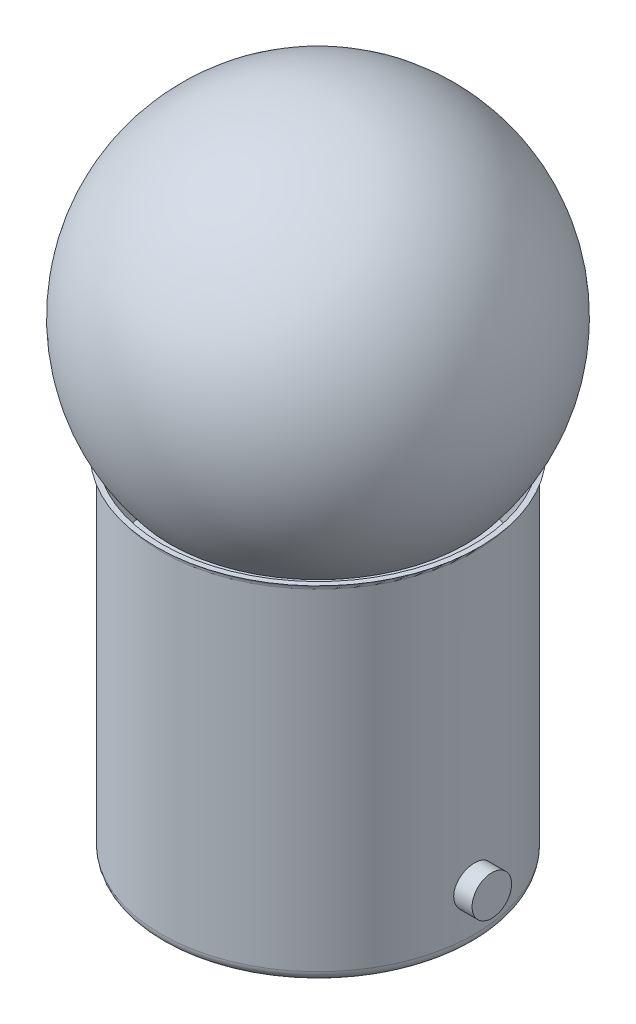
ISO-10303-21;
HEADER;
FILE_DESCRIPTION(('STEP AP214'),'2;1');
FILE_NAME('part.step','',(''),(''),'','','');
FILE_SCHEMA(('AUTOMOTIVE_DESIGN { 1 0 10303 214 1 1 1 1 }'));
ENDSEC;
DATA;
#1=APPLICATION_CONTEXT('core data for automotive mechanical design processes');
#2=APPLICATION_PROTOCOL_DEFINITION('international standard','automotive_design',2000,#1);
#3=PRODUCT_CONTEXT('',#1,'mechanical');
#4=PRODUCT('Part','Part','',(#3));
#5=PRODUCT_RELATED_PRODUCT_CATEGORY('part','',(#4));
#6=PRODUCT_DEFINITION_FORMATION('','',#4);
#7=PRODUCT_DEFINITION_CONTEXT('part definition',#1,'design');
#8=PRODUCT_DEFINITION('design','',#6,#7);
#9=PRODUCT_DEFINITION_SHAPE('','',#8);
#10=(LENGTH_UNIT() NAMED_UNIT(*) SI_UNIT(.MILLI.,.METRE.));
#11=(NAMED_UNIT(*) PLANE_ANGLE_UNIT() SI_UNIT($,.RADIAN.));
#12=(NAMED_UNIT(*) SI_UNIT($,.STERADIAN.) SOLID_ANGLE_UNIT());
#13=UNCERTAINTY_MEASURE_WITH_UNIT(LENGTH_MEASURE(1.E-05),#10,'distance_accuracy_value','');
#14=(GEOMETRIC_REPRESENTATION_CONTEXT(3) GLOBAL_UNCERTAINTY_ASSIGNED_CONTEXT((#13)) GLOBAL_UNIT_ASSIGNED_CONTEXT((#10,
#11,#12)) REPRESENTATION_CONTEXT('',''));
#15=CARTESIAN_POINT('',(0.,0.,0.));
#16=DIRECTION('',(0.,0.,1.));
#17=DIRECTION('',(1.,0.,0.));
#18=AXIS2_PLACEMENT_3D('',#15,#16,#17);
#19=CARTESIAN_POINT('',(0.,22.4917,0.));
#20=DIRECTION('',(0.,1.,0.));
#21=DIRECTION('',(0.,0.,-1.));
#22=AXIS2_PLACEMENT_3D('',#19,#20,#21);
#23=SPHERICAL_SURFACE('',#22,9.2583);
#24=CARTESIAN_POINT('',(0.,16.5639650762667,0.));
#25=DIRECTION('',(0.,1.,0.));
#26=DIRECTION('',(0.,0.,1.));
#27=AXIS2_PLACEMENT_3D('',#24,#25,#26);
#28=CIRCLE('',#27,7.11182659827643);
#29=CARTESIAN_POINT('',(0.,16.5639650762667,7.11182659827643));
#30=VERTEX_POINT('',#29);
#31=EDGE_CURVE('E11',#30,#30,#28,.T.);
#32=ORIENTED_EDGE('',*,*,#31,.T.);
#33=EDGE_LOOP('',(#32));
#34=FACE_BOUND('',#33,.T.);
#35=ADVANCED_FACE('F43',(#34),#23,.T.);
#36=CARTESIAN_POINT('',(0.,16.5639650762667,0.));
#37=DIRECTION('',(0.,1.,0.));
#38=DIRECTION('',(0.,0.,1.));
#39=AXIS2_PLACEMENT_3D('',#36,#37,#38);
#40=PLANE('',#39);
#41=ORIENTED_EDGE('',*,*,#31,.F.);
#42=EDGE_LOOP('',(#41));
#43=FACE_BOUND('',#42,.T.);
#44=ADVANCED_FACE('F51',(#43),#40,.F.);
#45=CLOSED_SHELL('',(#35,#44));
#46=MANIFOLD_SOLID_BREP('B2',#45);
#47=CARTESIAN_POINT('',(0.,0.,0.));
#48=DIRECTION('',(0.,1.,0.));
#49=DIRECTION('',(0.,0.,1.));
#50=AXIS2_PLACEMENT_3D('',#47,#48,#49);
#51=PLANE('',#50);
#52=CARTESIAN_POINT('',(0.,0.,0.));
#53=DIRECTION('',(0.,1.,0.));
#54=DIRECTION('',(0.,0.,1.));
#55=AXIS2_PLACEMENT_3D('',#52,#53,#54);
#56=CIRCLE('',#55,7.0485);
#57=CARTESIAN_POINT('',(0.,0.,7.0485));
#58=VERTEX_POINT('',#57);
#59=EDGE_CURVE('E80',#58,#58,#56,.F.);
#60=ORIENTED_EDGE('',*,*,#59,.T.);
#61=EDGE_LOOP('',(#60));
#62=FACE_BOUND('',#61,.T.);
#63=CARTESIAN_POINT('',(0.,0.,0.));
#64=DIRECTION('',(0.,1.,0.));
#65=DIRECTION('',(0.,0.,1.));
#66=AXIS2_PLACEMENT_3D('',#63,#64,#65);
#67=CIRCLE('',#66,3.8862);
#68=CARTESIAN_POINT('',(0.,0.,3.8862));
#69=VERTEX_POINT('',#68);
#70=EDGE_CURVE('E42',#69,#69,#67,.F.);
#71=ORIENTED_EDGE('',*,*,#70,.F.);
#72=EDGE_LOOP('',(#71));
#73=FACE_BOUND('',#72,.T.);
#74=ADVANCED_FACE('F69',(#62,#73),#51,.F.);
#75=CARTESIAN_POINT('',(0.,16.4846,0.));
#76=DIRECTION('',(0.,-1.,0.));
#77=DIRECTION('',(0.,0.,-1.));
#78=AXIS2_PLACEMENT_3D('',#75,#76,#77);
#79=CYLINDRICAL_SURFACE('',#78,7.5565);
#80=CARTESIAN_POINT('',(-7.49622811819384,2.54,-0.9525));
#81=CARTESIAN_POINT('',(-7.49622888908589,2.59327382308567,-0.952497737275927));
#82=CARTESIAN_POINT('',(-7.49680215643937,2.64658085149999,-0.948015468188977));
#83=CARTESIAN_POINT('',(-7.49903239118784,2.75171110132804,-0.930205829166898));
#84=CARTESIAN_POINT('',(-7.50069048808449,2.80353271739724,-0.916869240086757));
#85=CARTESIAN_POINT('',(-7.50489965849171,2.90415482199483,-0.881750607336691));
#86=CARTESIAN_POINT('',(-7.50745012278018,2.95295734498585,-0.859974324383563));
#87=CARTESIAN_POINT('',(-7.51315592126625,3.0462063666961,-0.808606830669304));
#88=CARTESIAN_POINT('',(-7.5163111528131,3.09065360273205,-0.779016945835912));
#89=CARTESIAN_POINT('',(-7.52289107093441,3.17419221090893,-0.712681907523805));
#90=CARTESIAN_POINT('',(-7.52631704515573,3.21325522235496,-0.675901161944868));
#91=CARTESIAN_POINT('',(-7.53304085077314,3.2846715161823,-0.596305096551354));
#92=CARTESIAN_POINT('',(-7.53633867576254,3.31702446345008,-0.55348947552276));
#93=CARTESIAN_POINT('',(-7.54244779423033,3.37420408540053,-0.462860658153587));
#94=CARTESIAN_POINT('',(-7.54525741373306,3.39900507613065,-0.415031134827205));
#95=CARTESIAN_POINT('',(-7.55005939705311,3.44021225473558,-0.315844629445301));
#96=CARTESIAN_POINT('',(-7.55205179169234,3.45661875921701,-0.264487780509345));
#97=CARTESIAN_POINT('',(-7.55498576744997,3.48048646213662,-0.159994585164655));
#98=CARTESIAN_POINT('',(-7.5559328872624,3.48799482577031,-0.106869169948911));
#99=CARTESIAN_POINT('',(-7.55668851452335,3.49399929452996,-0.000104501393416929));
#100=CARTESIAN_POINT('',(-7.55649706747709,3.49249575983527,0.0535347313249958));
#101=CARTESIAN_POINT('',(-7.55500161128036,3.48055688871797,0.159483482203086));
#102=CARTESIAN_POINT('',(-7.5537039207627,3.47017227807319,0.211798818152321));
#103=CARTESIAN_POINT('',(-7.55014888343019,3.44084534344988,0.313938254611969));
#104=CARTESIAN_POINT('',(-7.5478915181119,3.42190285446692,0.363762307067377));
#105=CARTESIAN_POINT('',(-7.54265989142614,3.37594400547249,0.459661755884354));
#106=CARTESIAN_POINT('',(-7.53968368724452,3.34890571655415,0.50572653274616));
#107=CARTESIAN_POINT('',(-7.53334730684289,3.28753874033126,0.592683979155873));
#108=CARTESIAN_POINT('',(-7.52998711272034,3.25320971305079,0.633576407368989));
#109=CARTESIAN_POINT('',(-7.52323118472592,3.17795168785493,0.709326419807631));
#110=CARTESIAN_POINT('',(-7.51983536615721,3.13697847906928,0.744140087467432));
#111=CARTESIAN_POINT('',(-7.51341395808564,3.04974698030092,0.806402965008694));
#112=CARTESIAN_POINT('',(-7.5103883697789,3.00348867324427,0.833852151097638));
#113=CARTESIAN_POINT('',(-7.50505002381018,2.90696069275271,0.88060952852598));
#114=CARTESIAN_POINT('',(-7.50273757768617,2.85668927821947,0.899914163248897));
#115=CARTESIAN_POINT('',(-7.4990933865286,2.75358260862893,0.929795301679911));
#116=CARTESIAN_POINT('',(-7.49776159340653,2.70074747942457,0.940372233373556));
#117=CARTESIAN_POINT('',(-7.49623829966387,2.59440115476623,0.952439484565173));
#118=CARTESIAN_POINT('',(-7.49603904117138,2.54089708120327,0.953991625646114));
#119=CARTESIAN_POINT('',(-7.49678285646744,2.43439165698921,0.948128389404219));
#120=CARTESIAN_POINT('',(-7.4977259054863,2.38139029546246,0.940713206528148));
#121=CARTESIAN_POINT('',(-7.50064099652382,2.27758031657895,0.917177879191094));
#122=CARTESIAN_POINT('',(-7.50260949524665,2.22676479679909,0.901087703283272));
#123=CARTESIAN_POINT('',(-7.50735080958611,2.12855296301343,0.860689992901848));
#124=CARTESIAN_POINT('',(-7.51012365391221,2.08115677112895,0.83638216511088));
#125=CARTESIAN_POINT('',(-7.51617979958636,1.99084939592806,0.780087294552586));
#126=CARTESIAN_POINT('',(-7.51946576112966,1.94796365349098,0.748059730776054));
#127=CARTESIAN_POINT('',(-7.52616955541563,1.86815420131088,0.677291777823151));
#128=CARTESIAN_POINT('',(-7.52958739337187,1.83123072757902,0.638551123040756));
#129=CARTESIAN_POINT('',(-7.53619368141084,1.76417657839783,0.555186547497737));
#130=CARTESIAN_POINT('',(-7.53938068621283,1.73408653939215,0.51052980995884));
#131=CARTESIAN_POINT('',(-7.545144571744,1.68183465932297,0.416760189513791));
#132=CARTESIAN_POINT('',(-7.54772146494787,1.6596726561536,0.367647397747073));
#133=CARTESIAN_POINT('',(-7.55196836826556,1.62397296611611,0.266494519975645));
#134=CARTESIAN_POINT('',(-7.55364084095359,1.61041184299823,0.214462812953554));
#135=CARTESIAN_POINT('',(-7.55590069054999,1.59222263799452,0.108838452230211));
#136=CARTESIAN_POINT('',(-7.55648811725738,1.58759414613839,0.0552458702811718));
#137=CARTESIAN_POINT('',(-7.55651144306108,1.58740934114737,-0.0515822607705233));
#138=CARTESIAN_POINT('',(-7.55595529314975,1.59179038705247,-0.104817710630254));
#139=CARTESIAN_POINT('',(-7.55376976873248,1.60936756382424,-0.209789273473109));
#140=CARTESIAN_POINT('',(-7.55214039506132,1.62256368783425,-0.261525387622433));
#141=CARTESIAN_POINT('',(-7.54799068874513,1.65737666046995,-0.362021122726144));
#142=CARTESIAN_POINT('',(-7.54547067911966,1.67899045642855,-0.410781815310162));
#143=CARTESIAN_POINT('',(-7.53981865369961,1.73001874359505,-0.503993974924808));
#144=CARTESIAN_POINT('',(-7.53668663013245,1.75943333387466,-0.548445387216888));
#145=CARTESIAN_POINT('',(-7.53013415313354,1.8254598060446,-0.632097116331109));
#146=CARTESIAN_POINT('',(-7.52671191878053,1.86211828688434,-0.67126051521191));
#147=CARTESIAN_POINT('',(-7.51997897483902,1.94149507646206,-0.7429043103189));
#148=CARTESIAN_POINT('',(-7.51666829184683,1.98421481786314,-0.775383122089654));
#149=CARTESIAN_POINT('',(-7.51051943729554,2.07469406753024,-0.832845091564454));
#150=CARTESIAN_POINT('',(-7.50768317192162,2.12247270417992,-0.857798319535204));
#151=CARTESIAN_POINT('',(-7.50282662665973,2.2215514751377,-0.899291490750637));
#152=CARTESIAN_POINT('',(-7.50080546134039,2.27284771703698,-0.9158405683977));
#153=CARTESIAN_POINT('',(-7.49829780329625,2.36034012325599,-0.936101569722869));
#154=CARTESIAN_POINT('',(-7.49752554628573,2.39598482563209,-0.942242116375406));
#155=CARTESIAN_POINT('',(-7.49649044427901,2.46774792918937,-0.950442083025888));
#156=CARTESIAN_POINT('',(-7.49622759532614,2.50386632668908,-0.952501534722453));
#157=CARTESIAN_POINT('',(-7.49622811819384,2.54,-0.9525));
#158=B_SPLINE_CURVE_WITH_KNOTS('',3,(#80,#81,#82,#83,#84,#85,#86,#87,#88,#89,#90,#91,#92,#93,
#94,#95,#96,#97,#98,#99,#100,#101,#102,#103,#104,#105,#106,#107,#108,#109,#110,#111,#112,#113,
#114,#115,#116,#117,#118,#119,#120,#121,#122,#123,#124,#125,#126,#127,#128,#129,#130,#131,#132,
#133,#134,#135,#136,#137,#138,#139,#140,#141,#142,#143,#144,#145,#146,#147,#148,#149,#150,#151,
#152,#153,#154,#155,#156,#157),.UNSPECIFIED.,.T.,.F.,(4,2,2,2,2,2,2,2,2,2,2,2,2,2,2,2,2,2,2,2,2,
2,2,2,2,2,2,2,2,2,2,2,2,2,2,2,2,2,4),(0.,0.159689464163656,0.319545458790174,0.479292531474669,
0.639012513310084,0.799544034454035,0.960083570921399,1.12116315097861,1.28223665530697,
1.44245250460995,1.6026619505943,1.76196239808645,1.92126591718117,2.08100490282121,
2.24075133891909,2.40160799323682,2.56246516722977,2.72339251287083,2.88431196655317,
3.04412777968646,3.20394012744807,3.36320389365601,3.52247334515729,3.68259774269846,
3.84272847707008,4.0037878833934,4.16484399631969,4.32545934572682,4.48606732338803,
4.64556241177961,4.80505737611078,4.9644945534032,5.12393375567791,5.28443411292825,
5.44497247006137,5.60614112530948,5.76713423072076,5.87544655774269,5.98375804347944),.UNSPECIFIED.);
#159=CARTESIAN_POINT('',(-7.49622811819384,2.54,-0.9525));
#160=VERTEX_POINT('',#159);
#161=EDGE_CURVE('E73',#160,#160,#158,.T.);
#162=ORIENTED_EDGE('',*,*,#161,.T.);
#163=EDGE_LOOP('',(#162));
#164=FACE_BOUND('',#163,.T.);
#165=CARTESIAN_POINT('',(7.49622811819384,2.54,-0.9525));
#166=CARTESIAN_POINT('',(7.49622888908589,2.48672617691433,-0.952497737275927));
#167=CARTESIAN_POINT('',(7.49680215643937,2.43341914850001,-0.948015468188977));
#168=CARTESIAN_POINT('',(7.49903239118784,2.32828889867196,-0.930205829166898));
#169=CARTESIAN_POINT('',(7.50069048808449,2.27646728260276,-0.916869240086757));
#170=CARTESIAN_POINT('',(7.50489965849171,2.17584517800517,-0.881750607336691));
#171=CARTESIAN_POINT('',(7.50745012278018,2.12704265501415,-0.859974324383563));
#172=CARTESIAN_POINT('',(7.51315592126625,2.0337936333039,-0.808606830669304));
#173=CARTESIAN_POINT('',(7.5163111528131,1.98934639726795,-0.779016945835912));
#174=CARTESIAN_POINT('',(7.52289107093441,1.90580778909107,-0.712681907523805));
#175=CARTESIAN_POINT('',(7.52631704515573,1.86674477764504,-0.675901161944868));
#176=CARTESIAN_POINT('',(7.53304085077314,1.79532848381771,-0.596305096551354));
#177=CARTESIAN_POINT('',(7.53633867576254,1.76297553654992,-0.55348947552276));
#178=CARTESIAN_POINT('',(7.54244779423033,1.70579591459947,-0.462860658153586));
#179=CARTESIAN_POINT('',(7.54525741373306,1.68099492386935,-0.415031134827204));
#180=CARTESIAN_POINT('',(7.55005939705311,1.63978774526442,-0.315844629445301));
#181=CARTESIAN_POINT('',(7.55205179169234,1.62338124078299,-0.264487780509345));
#182=CARTESIAN_POINT('',(7.55498576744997,1.59951353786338,-0.159994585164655));
#183=CARTESIAN_POINT('',(7.5559328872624,1.59200517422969,-0.106869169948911));
#184=CARTESIAN_POINT('',(7.55668851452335,1.58600070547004,-0.000104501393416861));
#185=CARTESIAN_POINT('',(7.55649706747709,1.58750424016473,0.0535347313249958));
#186=CARTESIAN_POINT('',(7.55500161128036,1.59944311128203,0.159483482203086));
#187=CARTESIAN_POINT('',(7.5537039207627,1.60982772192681,0.211798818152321));
#188=CARTESIAN_POINT('',(7.55014888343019,1.63915465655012,0.313938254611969));
#189=CARTESIAN_POINT('',(7.5478915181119,1.65809714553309,0.363762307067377));
#190=CARTESIAN_POINT('',(7.54265989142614,1.70405599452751,0.459661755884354));
#191=CARTESIAN_POINT('',(7.53968368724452,1.73109428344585,0.50572653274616));
#192=CARTESIAN_POINT('',(7.53334730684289,1.79246125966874,0.592683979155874));
#193=CARTESIAN_POINT('',(7.52998711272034,1.82679028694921,0.63357640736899));
#194=CARTESIAN_POINT('',(7.52323118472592,1.90204831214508,0.709326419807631));
#195=CARTESIAN_POINT('',(7.51983536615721,1.94302152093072,0.744140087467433));
#196=CARTESIAN_POINT('',(7.51341395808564,2.03025301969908,0.806402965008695));
#197=CARTESIAN_POINT('',(7.5103883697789,2.07651132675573,0.833852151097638));
#198=CARTESIAN_POINT('',(7.50505002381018,2.17303930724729,0.880609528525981));
#199=CARTESIAN_POINT('',(7.50273757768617,2.22331072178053,0.899914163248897));
#200=CARTESIAN_POINT('',(7.4990933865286,2.32641739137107,0.929795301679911));
#201=CARTESIAN_POINT('',(7.49776159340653,2.37925252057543,0.940372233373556));
#202=CARTESIAN_POINT('',(7.49623829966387,2.48559884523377,0.952439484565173));
#203=CARTESIAN_POINT('',(7.49603904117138,2.53910291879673,0.953991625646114));
#204=CARTESIAN_POINT('',(7.49678285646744,2.6456083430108,0.948128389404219));
#205=CARTESIAN_POINT('',(7.4977259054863,2.69860970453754,0.940713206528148));
#206=CARTESIAN_POINT('',(7.50064099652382,2.80241968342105,0.917177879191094));
#207=CARTESIAN_POINT('',(7.50260949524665,2.85323520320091,0.901087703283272));
#208=CARTESIAN_POINT('',(7.50735080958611,2.95144703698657,0.860689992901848));
#209=CARTESIAN_POINT('',(7.51012365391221,2.99884322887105,0.83638216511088));
#210=CARTESIAN_POINT('',(7.51617979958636,3.08915060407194,0.780087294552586));
#211=CARTESIAN_POINT('',(7.51946576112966,3.13203634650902,0.748059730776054));
#212=CARTESIAN_POINT('',(7.52616955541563,3.21184579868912,0.677291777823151));
#213=CARTESIAN_POINT('',(7.52958739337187,3.24876927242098,0.638551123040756));
#214=CARTESIAN_POINT('',(7.53619368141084,3.31582342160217,0.555186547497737));
#215=CARTESIAN_POINT('',(7.53938068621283,3.34591346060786,0.51052980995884));
#216=CARTESIAN_POINT('',(7.545144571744,3.39816534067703,0.41676018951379));
#217=CARTESIAN_POINT('',(7.54772146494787,3.4203273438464,0.367647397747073));
#218=CARTESIAN_POINT('',(7.55196836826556,3.45602703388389,0.266494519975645));
#219=CARTESIAN_POINT('',(7.55364084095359,3.46958815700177,0.214462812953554));
#220=CARTESIAN_POINT('',(7.55590069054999,3.48777736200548,0.108838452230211));
#221=CARTESIAN_POINT('',(7.55648811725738,3.49240585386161,0.0552458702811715));
#222=CARTESIAN_POINT('',(7.55651144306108,3.49259065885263,-0.0515822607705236));
#223=CARTESIAN_POINT('',(7.55595529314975,3.48820961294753,-0.104817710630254));
#224=CARTESIAN_POINT('',(7.55376976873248,3.47063243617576,-0.209789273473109));
#225=CARTESIAN_POINT('',(7.55214039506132,3.45743631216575,-0.261525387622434));
#226=CARTESIAN_POINT('',(7.54799068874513,3.42262333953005,-0.362021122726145));
#227=CARTESIAN_POINT('',(7.54547067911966,3.40100954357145,-0.410781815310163));
#228=CARTESIAN_POINT('',(7.53981865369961,3.34998125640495,-0.503993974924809));
#229=CARTESIAN_POINT('',(7.53668663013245,3.32056666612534,-0.548445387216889));
#230=CARTESIAN_POINT('',(7.53013415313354,3.2545401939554,-0.632097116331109));
#231=CARTESIAN_POINT('',(7.52671191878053,3.21788171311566,-0.67126051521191));
#232=CARTESIAN_POINT('',(7.51997897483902,3.13850492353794,-0.7429043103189));
#233=CARTESIAN_POINT('',(7.51666829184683,3.09578518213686,-0.775383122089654));
#234=CARTESIAN_POINT('',(7.51051943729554,3.00530593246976,-0.832845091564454));
#235=CARTESIAN_POINT('',(7.50768317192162,2.95752729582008,-0.857798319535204));
#236=CARTESIAN_POINT('',(7.50282662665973,2.8584485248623,-0.899291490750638));
#237=CARTESIAN_POINT('',(7.50080546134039,2.80715228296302,-0.9158405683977));
#238=CARTESIAN_POINT('',(7.49829780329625,2.71965987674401,-0.936101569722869));
#239=CARTESIAN_POINT('',(7.49752554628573,2.68401517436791,-0.942242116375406));
#240=CARTESIAN_POINT('',(7.49649044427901,2.61225207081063,-0.950442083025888));
#241=CARTESIAN_POINT('',(7.49622759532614,2.57613367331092,-0.952501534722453));
#242=CARTESIAN_POINT('',(7.49622811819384,2.54,-0.9525));
#243=B_SPLINE_CURVE_WITH_KNOTS('',3,(#165,#166,#167,#168,#169,#170,#171,#172,#173,#174,#175,
#176,#177,#178,#179,#180,#181,#182,#183,#184,#185,#186,#187,#188,#189,#190,#191,#192,#193,#194,
#195,#196,#197,#198,#199,#200,#201,#202,#203,#204,#205,#206,#207,#208,#209,#210,#211,#212,#213,
#214,#215,#216,#217,#218,#219,#220,#221,#222,#223,#224,#225,#226,#227,#228,#229,#230,#231,#232,
#233,#234,#235,#236,#237,#238,#239,#240,#241,#242),.UNSPECIFIED.,.T.,.F.,(4,2,2,2,2,2,2,2,2,2,2,
2,2,2,2,2,2,2,2,2,2,2,2,2,2,2,2,2,2,2,2,2,2,2,2,2,2,2,4),(0.,0.159689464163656,
0.319545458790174,0.479292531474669,0.639012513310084,0.799544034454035,0.9600835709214,
1.12116315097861,1.28223665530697,1.44245250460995,1.6026619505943,1.76196239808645,
1.92126591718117,2.08100490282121,2.24075133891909,2.40160799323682,2.56246516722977,
2.72339251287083,2.88431196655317,3.04412777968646,3.20394012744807,3.36320389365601,
3.52247334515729,3.68259774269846,3.84272847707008,4.0037878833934,4.16484399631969,
4.32545934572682,4.48606732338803,4.64556241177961,4.80505737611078,4.9644945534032,
5.12393375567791,5.28443411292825,5.44497247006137,5.60614112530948,5.76713423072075,
5.87544655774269,5.98375804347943),.UNSPECIFIED.);
#244=CARTESIAN_POINT('',(7.49622811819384,2.54,-0.9525));
#245=VERTEX_POINT('',#244);
#246=EDGE_CURVE('E88',#245,#245,#243,.T.);
#247=ORIENTED_EDGE('',*,*,#246,.T.);
#248=EDGE_LOOP('',(#247));
#249=FACE_BOUND('',#248,.T.);
#250=CARTESIAN_POINT('',(0.,0.508000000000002,0.));
#251=DIRECTION('',(0.,1.,0.));
#252=DIRECTION('',(0.,0.,1.));
#253=AXIS2_PLACEMENT_3D('',#250,#251,#252);
#254=CIRCLE('',#253,7.5565);
#255=CARTESIAN_POINT('',(0.,0.508000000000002,7.5565));
#256=VERTEX_POINT('',#255);
#257=EDGE_CURVE('E85',#256,#256,#254,.T.);
#258=ORIENTED_EDGE('',*,*,#257,.T.);
#259=EDGE_LOOP('',(#258));
#260=FACE_BOUND('',#259,.T.);
#261=CARTESIAN_POINT('',(0.,16.4846,0.));
#262=DIRECTION('',(0.,1.,0.));
#263=DIRECTION('',(0.,0.,1.));
#264=AXIS2_PLACEMENT_3D('',#261,#262,#263);
#265=CIRCLE('',#264,7.5565);
#266=CARTESIAN_POINT('',(0.,16.4846,7.5565));
#267=VERTEX_POINT('',#266);
#268=EDGE_CURVE('E139',#267,#267,#265,.T.);
#269=ORIENTED_EDGE('',*,*,#268,.F.);
#270=EDGE_LOOP('',(#269));
#271=FACE_BOUND('',#270,.T.);
#272=ADVANCED_FACE('F93',(#164,#249,#260,#271),#79,.T.);
#273=CARTESIAN_POINT('',(0.,16.4846,0.));
#274=DIRECTION('',(0.,1.,0.));
#275=DIRECTION('',(0.,0.,1.));
#276=AXIS2_PLACEMENT_3D('',#273,#274,#275);
#277=TOROIDAL_SURFACE('',#276,7.85635807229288,0.299858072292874);
#278=CARTESIAN_POINT('',(0.,16.7711466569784,0.));
#279=DIRECTION('',(0.,1.,0.));
#280=DIRECTION('',(0.,0.,1.));
#281=AXIS2_PLACEMENT_3D('',#278,#279,#280);
#282=CIRCLE('',#281,7.76800719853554);
#283=CARTESIAN_POINT('',(0.,16.7711466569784,7.76800719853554));
#284=VERTEX_POINT('',#283);
#285=EDGE_CURVE('E146',#284,#284,#282,.T.);
#286=ORIENTED_EDGE('',*,*,#285,.F.);
#287=EDGE_LOOP('',(#286));
#288=FACE_BOUND('',#287,.T.);
#289=ORIENTED_EDGE('',*,*,#268,.T.);
#290=EDGE_LOOP('',(#289));
#291=FACE_BOUND('',#290,.T.);
#292=ADVANCED_FACE('F121',(#288,#291),#277,.F.);
#293=CARTESIAN_POINT('',(0.,16.4846,0.));
#294=DIRECTION('',(0.,1.,0.));
#295=DIRECTION('',(0.,0.,1.));
#296=AXIS2_PLACEMENT_3D('',#293,#294,#295);
#297=CYLINDRICAL_SURFACE('',#296,7.51110730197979);
#298=CARTESIAN_POINT('',(0.,16.7711466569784,0.));
#299=DIRECTION('',(0.,1.,0.));
#300=DIRECTION('',(0.,0.,1.));
#301=AXIS2_PLACEMENT_3D('',#298,#299,#300);
#302=CIRCLE('',#301,7.51110730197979);
#303=CARTESIAN_POINT('',(0.,16.7711466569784,7.51110730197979));
#304=VERTEX_POINT('',#303);
#305=EDGE_CURVE('E141',#304,#304,#302,.T.);
#306=ORIENTED_EDGE('',*,*,#305,.T.);
#307=EDGE_LOOP('',(#306));
#308=FACE_BOUND('',#307,.T.);
#309=CARTESIAN_POINT('',(0.,11.049,0.));
#310=DIRECTION('',(0.,1.,0.));
#311=DIRECTION('',(0.,0.,1.));
#312=AXIS2_PLACEMENT_3D('',#309,#310,#311);
#313=CIRCLE('',#312,7.51110730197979);
#314=CARTESIAN_POINT('',(0.,11.049,7.51110730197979));
#315=VERTEX_POINT('',#314);
#316=EDGE_CURVE('E157',#315,#315,#313,.T.);
#317=ORIENTED_EDGE('',*,*,#316,.F.);
#318=EDGE_LOOP('',(#317));
#319=FACE_BOUND('',#318,.T.);
#320=ADVANCED_FACE('F117',(#308,#319),#297,.F.);
#321=CARTESIAN_POINT('',(0.,16.7711466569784,-7.76800719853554));
#322=DIRECTION('',(0.,-1.,0.));
#323=DIRECTION('',(0.,0.,-1.));
#324=AXIS2_PLACEMENT_3D('',#321,#322,#323);
#325=PLANE('',#324);
#326=ORIENTED_EDGE('',*,*,#305,.F.);
#327=EDGE_LOOP('',(#326));
#328=FACE_BOUND('',#327,.T.);
#329=ORIENTED_EDGE('',*,*,#285,.T.);
#330=EDGE_LOOP('',(#329));
#331=FACE_BOUND('',#330,.T.);
#332=ADVANCED_FACE('F114',(#328,#331),#325,.F.);
#333=CARTESIAN_POINT('',(0.,0.508000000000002,0.));
#334=DIRECTION('',(0.,1.,0.));
#335=DIRECTION('',(0.,0.,1.));
#336=AXIS2_PLACEMENT_3D('',#333,#334,#335);
#337=TOROIDAL_SURFACE('',#336,7.0485,0.508);
#338=ORIENTED_EDGE('',*,*,#59,.F.);
#339=EDGE_LOOP('',(#338));
#340=FACE_BOUND('',#339,.T.);
#341=ORIENTED_EDGE('',*,*,#257,.F.);
#342=EDGE_LOOP('',(#341));
#343=FACE_BOUND('',#342,.T.);
#344=ADVANCED_FACE('F71',(#340,#343),#337,.T.);
#345=CARTESIAN_POINT('',(0.,-1.651,0.));
#346=DIRECTION('',(0.,1.,0.));
#347=DIRECTION('',(0.,0.,1.));
#348=AXIS2_PLACEMENT_3D('',#345,#346,#347);
#349=SPHERICAL_SURFACE('',#348,1.524);
#350=CARTESIAN_POINT('',(0.,-2.74403136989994,0.));
#351=DIRECTION('',(0.,1.,0.));
#352=DIRECTION('',(0.,0.,1.));
#353=AXIS2_PLACEMENT_3D('',#350,#351,#352);
#354=CIRCLE('',#353,1.06200679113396);
#355=CARTESIAN_POINT('',(0.,-2.74403136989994,1.06200679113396));
#356=VERTEX_POINT('',#355);
#357=EDGE_CURVE('E149',#356,#356,#354,.T.);
#358=ORIENTED_EDGE('',*,*,#357,.F.);
#359=EDGE_LOOP('',(#358));
#360=FACE_BOUND('',#359,.T.);
#361=ADVANCED_FACE('F110',(#360),#349,.T.);
#362=CARTESIAN_POINT('',(0.,-2.74403136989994,0.));
#363=DIRECTION('',(0.,1.,0.));
#364=DIRECTION('',(0.,0.,1.));
#365=AXIS2_PLACEMENT_3D('',#362,#363,#364);
#366=CONICAL_SURFACE('',#365,1.06200679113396,0.799793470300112);
#367=CARTESIAN_POINT('',(0.,0.,3.8862));
#368=CARTESIAN_POINT('',(0.,-0.028583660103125,3.85678132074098));
#369=CARTESIAN_POINT('',(0.,-0.0571673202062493,3.82736264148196));
#370=CARTESIAN_POINT('',(0.,-0.114334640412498,3.76852528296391));
#371=CARTESIAN_POINT('',(0.,-0.142918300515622,3.73910660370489));
#372=CARTESIAN_POINT('',(0.,-0.200085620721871,3.68026924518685));
#373=CARTESIAN_POINT('',(0.,-0.228669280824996,3.65085056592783));
#374=CARTESIAN_POINT('',(0.,-0.285836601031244,3.59201320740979));
#375=CARTESIAN_POINT('',(0.,-0.314420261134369,3.56259452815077));
#376=CARTESIAN_POINT('',(0.,-0.371587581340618,3.50375716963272));
#377=CARTESIAN_POINT('',(0.,-0.400171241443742,3.4743384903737));
#378=CARTESIAN_POINT('',(0.,-0.457338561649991,3.41550113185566));
#379=CARTESIAN_POINT('',(0.,-0.485922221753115,3.38608245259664));
#380=CARTESIAN_POINT('',(0.,-0.543089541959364,3.3272450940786));
#381=CARTESIAN_POINT('',(0.,-0.571673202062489,3.29782641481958));
#382=CARTESIAN_POINT('',(0.,-0.628840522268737,3.23898905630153));
#383=CARTESIAN_POINT('',(0.,-0.657424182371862,3.20957037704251));
#384=CARTESIAN_POINT('',(0.,-0.71459150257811,3.15073301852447));
#385=CARTESIAN_POINT('',(0.,-0.743175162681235,3.12131433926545));
#386=CARTESIAN_POINT('',(0.,-0.800342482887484,3.0624769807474));
#387=CARTESIAN_POINT('',(0.,-0.828926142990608,3.03305830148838));
#388=CARTESIAN_POINT('',(0.,-0.886093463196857,2.97422094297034));
#389=CARTESIAN_POINT('',(0.,-0.914677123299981,2.94480226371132));
#390=CARTESIAN_POINT('',(0.,-0.97184444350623,2.88596490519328));
#391=CARTESIAN_POINT('',(0.,-1.00042810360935,2.85654622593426));
#392=CARTESIAN_POINT('',(0.,-1.0575954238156,2.79770886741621));
#393=CARTESIAN_POINT('',(0.,-1.08617908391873,2.76829018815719));
#394=CARTESIAN_POINT('',(0.,-1.14334640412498,2.70945282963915));
#395=CARTESIAN_POINT('',(0.,-1.1719300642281,2.68003415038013));
#396=CARTESIAN_POINT('',(0.,-1.22909738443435,2.62119679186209));
#397=CARTESIAN_POINT('',(0.,-1.25768104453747,2.59177811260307));
#398=CARTESIAN_POINT('',(0.,-1.31484836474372,2.53294075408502));
#399=CARTESIAN_POINT('',(0.,-1.34343202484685,2.503522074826));
#400=CARTESIAN_POINT('',(0.,-1.4005993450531,2.44468471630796));
#401=CARTESIAN_POINT('',(0.,-1.42918300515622,2.41526603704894));
#402=CARTESIAN_POINT('',(0.,-1.48635032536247,2.3564286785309));
#403=CARTESIAN_POINT('',(0.,-1.51493398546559,2.32700999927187));
#404=CARTESIAN_POINT('',(0.,-1.57210130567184,2.26817264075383));
#405=CARTESIAN_POINT('',(0.,-1.60068496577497,2.23875396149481));
#406=CARTESIAN_POINT('',(0.,-1.65785228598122,2.17991660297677));
#407=CARTESIAN_POINT('',(0.,-1.68643594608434,2.15049792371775));
#408=CARTESIAN_POINT('',(0.,-1.74360326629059,2.09166056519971));
#409=CARTESIAN_POINT('',(0.,-1.77218692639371,2.06224188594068));
#410=CARTESIAN_POINT('',(0.,-1.82935424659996,2.00340452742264));
#411=CARTESIAN_POINT('',(0.,-1.85793790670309,1.97398584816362));
#412=CARTESIAN_POINT('',(0.,-1.91510522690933,1.91514848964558));
#413=CARTESIAN_POINT('',(0.,-1.94368888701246,1.88572981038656));
#414=CARTESIAN_POINT('',(0.,-2.00085620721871,1.82689245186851));
#415=CARTESIAN_POINT('',(0.,-2.02943986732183,1.79747377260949));
#416=CARTESIAN_POINT('',(0.,-2.08660718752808,1.73863641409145));
#417=CARTESIAN_POINT('',(0.,-2.11519084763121,1.70921773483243));
#418=CARTESIAN_POINT('',(0.,-2.17235816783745,1.65038037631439));
#419=CARTESIAN_POINT('',(0.,-2.20094182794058,1.62096169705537));
#420=CARTESIAN_POINT('',(0.,-2.25810914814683,1.56212433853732));
#421=CARTESIAN_POINT('',(0.,-2.28669280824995,1.5327056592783));
#422=CARTESIAN_POINT('',(0.,-2.3438601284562,1.47386830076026));
#423=CARTESIAN_POINT('',(0.,-2.37244378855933,1.44444962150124));
#424=CARTESIAN_POINT('',(0.,-2.42961110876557,1.3856122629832));
#425=CARTESIAN_POINT('',(0.,-2.4581947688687,1.35619358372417));
#426=CARTESIAN_POINT('',(0.,-2.51536208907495,1.29735622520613));
#427=CARTESIAN_POINT('',(0.,-2.54394574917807,1.26793754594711));
#428=CARTESIAN_POINT('',(0.,-2.60111306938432,1.20910018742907));
#429=CARTESIAN_POINT('',(0.,-2.62969672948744,1.17968150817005));
#430=CARTESIAN_POINT('',(0.,-2.68686404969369,1.120844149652));
#431=CARTESIAN_POINT('',(0.,-2.71544770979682,1.09142547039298));
#432=CARTESIAN_POINT('',(0.,-2.74403136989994,1.06200679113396));
#433=B_SPLINE_CURVE_WITH_KNOTS('',3,(#367,#368,#369,#370,#371,#372,#373,#374,#375,#376,#377,
#378,#379,#380,#381,#382,#383,#384,#385,#386,#387,#388,#389,#390,#391,#392,#393,#394,#395,#396,
#397,#398,#399,#400,#401,#402,#403,#404,#405,#406,#407,#408,#409,#410,#411,#412,#413,#414,#415,
#416,#417,#418,#419,#420,#421,#422,#423,#424,#425,#426,#427,#428,#429,#430,#431,#432),
.UNSPECIFIED.,.F.,.F.,(4,2,2,2,2,2,2,2,2,2,2,2,2,2,2,2,2,2,2,2,2,2,2,2,2,2,2,2,2,2,2,2,4),(0.,
0.123054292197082,0.246108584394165,0.369162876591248,0.49221716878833,0.615271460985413,
0.738325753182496,0.861380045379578,0.984434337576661,1.10748862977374,1.23054292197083,
1.35359721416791,1.47665150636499,1.59970579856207,1.72276009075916,1.84581438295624,
1.96886867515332,2.0919229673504,2.21497725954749,2.33803155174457,2.46108584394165,
2.58414013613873,2.70719442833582,2.8302487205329,2.95330301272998,3.07635730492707,
3.19941159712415,3.32246588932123,3.44552018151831,3.5685744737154,3.69162876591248,
3.81468305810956,3.93773735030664),.UNSPECIFIED.);
#434=EDGE_CURVE('BSEAM105',#69,#356,#433,.T.);
#435=ORIENTED_EDGE('',*,*,#70,.T.);
#436=ORIENTED_EDGE('',*,*,#357,.T.);
#437=ORIENTED_EDGE('',*,*,#434,.T.);
#438=ORIENTED_EDGE('',*,*,#434,.F.);
#439=EDGE_LOOP('',(#435,#437,#436,#438));
#440=FACE_BOUND('',#439,.T.);
#441=ADVANCED_FACE('F105',(#440),#366,.T.);
#442=CARTESIAN_POINT('',(8.382,2.54,0.));
#443=DIRECTION('',(1.,0.,0.));
#444=DIRECTION('',(0.,0.,-1.));
#445=AXIS2_PLACEMENT_3D('',#442,#443,#444);
#446=PLANE('',#445);
#447=CARTESIAN_POINT('',(8.382,2.54,0.));
#448=DIRECTION('',(1.,0.,0.));
#449=DIRECTION('',(0.,0.,-1.));
#450=AXIS2_PLACEMENT_3D('',#447,#448,#449);
#451=CIRCLE('',#450,0.9525);
#452=CARTESIAN_POINT('',(8.382,2.54,-0.9525));
#453=VERTEX_POINT('',#452);
#454=EDGE_CURVE('E154',#453,#453,#451,.T.);
#455=ORIENTED_EDGE('',*,*,#454,.T.);
#456=EDGE_LOOP('',(#455));
#457=FACE_BOUND('',#456,.T.);
#458=ADVANCED_FACE('F109',(#457),#446,.T.);
#459=CARTESIAN_POINT('',(-8.4582,2.54,0.));
#460=DIRECTION('',(1.,0.,0.));
#461=DIRECTION('',(0.,0.,-1.));
#462=AXIS2_PLACEMENT_3D('',#459,#460,#461);
#463=CYLINDRICAL_SURFACE('',#462,0.9525);
#464=ORIENTED_EDGE('',*,*,#454,.F.);
#465=EDGE_LOOP('',(#464));
#466=FACE_BOUND('',#465,.T.);
#467=ORIENTED_EDGE('',*,*,#246,.F.);
#468=EDGE_LOOP('',(#467));
#469=FACE_BOUND('',#468,.T.);
#470=ADVANCED_FACE('F102',(#466,#469),#463,.T.);
#471=CARTESIAN_POINT('',(-8.4582,2.54,0.));
#472=DIRECTION('',(1.,0.,0.));
#473=DIRECTION('',(0.,0.,-1.));
#474=AXIS2_PLACEMENT_3D('',#471,#472,#473);
#475=CIRCLE('',#474,0.9525);
#476=CARTESIAN_POINT('',(-8.4582,2.54,-0.9525));
#477=VERTEX_POINT('',#476);
#478=EDGE_CURVE('E92',#477,#477,#475,.T.);
#479=ORIENTED_EDGE('',*,*,#478,.T.);
#480=EDGE_LOOP('',(#479));
#481=FACE_BOUND('',#480,.T.);
#482=ORIENTED_EDGE('',*,*,#161,.F.);
#483=EDGE_LOOP('',(#482));
#484=FACE_BOUND('',#483,.T.);
#485=ADVANCED_FACE('F96',(#481,#484),#463,.T.);
#486=CARTESIAN_POINT('',(-8.4582,2.54,0.));
#487=DIRECTION('',(1.,0.,0.));
#488=DIRECTION('',(0.,0.,-1.));
#489=AXIS2_PLACEMENT_3D('',#486,#487,#488);
#490=PLANE('',#489);
#491=ORIENTED_EDGE('',*,*,#478,.F.);
#492=EDGE_LOOP('',(#491));
#493=FACE_BOUND('',#492,.T.);
#494=ADVANCED_FACE('F101',(#493),#490,.F.);
#495=CARTESIAN_POINT('',(0.,11.049,0.));
#496=DIRECTION('',(0.,1.,0.));
#497=DIRECTION('',(0.,0.,1.));
#498=AXIS2_PLACEMENT_3D('',#495,#496,#497);
#499=PLANE('',#498);
#500=ORIENTED_EDGE('',*,*,#316,.T.);
#501=EDGE_LOOP('',(#500));
#502=FACE_BOUND('',#501,.T.);
#503=ADVANCED_FACE('F161',(#502),#499,.T.);
#504=CLOSED_SHELL('',(#74,#272,#292,#320,#332,#344,#361,#441,#458,#470,#485,#494,#503));
#505=MANIFOLD_SOLID_BREP('B6',#504);
#506=ADVANCED_BREP_SHAPE_REPRESENTATION('',(#18,#46,#505),#14);
#507=SHAPE_DEFINITION_REPRESENTATION(#9,#506);
ENDSEC;
END-ISO-10303-21;
